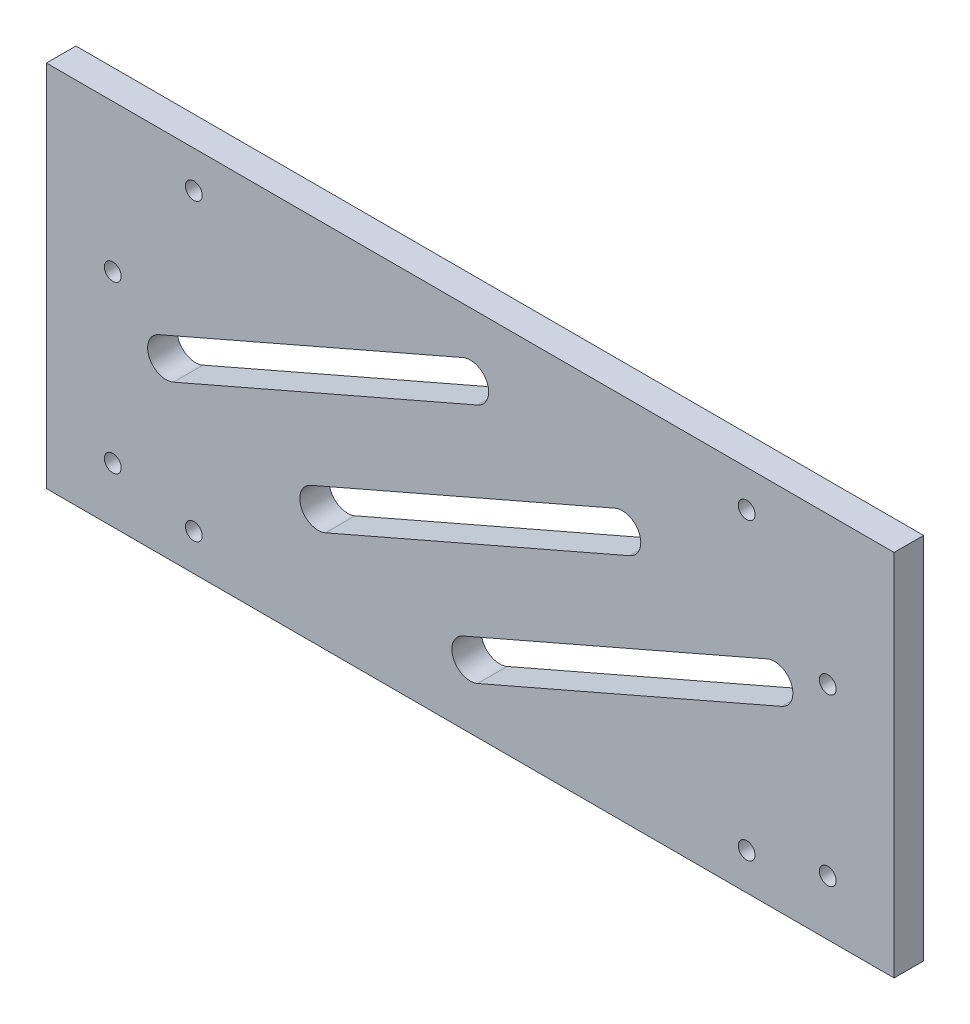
ISO-10303-21;
HEADER;
FILE_DESCRIPTION(('STEP AP214'),'2;1');
FILE_NAME('part.step','',(''),(''),'','','');
FILE_SCHEMA(('AUTOMOTIVE_DESIGN { 1 0 10303 214 1 1 1 1 }'));
ENDSEC;
DATA;
#1=APPLICATION_CONTEXT('core data for automotive mechanical design processes');
#2=APPLICATION_PROTOCOL_DEFINITION('international standard','automotive_design',2000,#1);
#3=PRODUCT_CONTEXT('',#1,'mechanical');
#4=PRODUCT('Part','Part','',(#3));
#5=PRODUCT_RELATED_PRODUCT_CATEGORY('part','',(#4));
#6=PRODUCT_DEFINITION_FORMATION('','',#4);
#7=PRODUCT_DEFINITION_CONTEXT('part definition',#1,'design');
#8=PRODUCT_DEFINITION('design','',#6,#7);
#9=PRODUCT_DEFINITION_SHAPE('','',#8);
#10=(LENGTH_UNIT() NAMED_UNIT(*) SI_UNIT(.MILLI.,.METRE.));
#11=(NAMED_UNIT(*) PLANE_ANGLE_UNIT() SI_UNIT($,.RADIAN.));
#12=(NAMED_UNIT(*) SI_UNIT($,.STERADIAN.) SOLID_ANGLE_UNIT());
#13=UNCERTAINTY_MEASURE_WITH_UNIT(LENGTH_MEASURE(1.E-05),#10,'distance_accuracy_value','');
#14=(GEOMETRIC_REPRESENTATION_CONTEXT(3) GLOBAL_UNCERTAINTY_ASSIGNED_CONTEXT((#13)) GLOBAL_UNIT_ASSIGNED_CONTEXT((#10,
#11,#12)) REPRESENTATION_CONTEXT('',''));
#15=CARTESIAN_POINT('',(0.,0.,0.));
#16=DIRECTION('',(0.,0.,1.));
#17=DIRECTION('',(1.,0.,0.));
#18=AXIS2_PLACEMENT_3D('',#15,#16,#17);
#19=CARTESIAN_POINT('',(0.,0.,8.));
#20=DIRECTION('',(0.,0.,1.));
#21=DIRECTION('',(1.,0.,0.));
#22=AXIS2_PLACEMENT_3D('',#19,#20,#21);
#23=PLANE('',#22);
#24=CARTESIAN_POINT('',(75.,40.,8.));
#25=DIRECTION('',(0.,0.,1.));
#26=DIRECTION('',(1.,0.,0.));
#27=AXIS2_PLACEMENT_3D('',#24,#25,#26);
#28=CIRCLE('',#27,2.28499999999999);
#29=CARTESIAN_POINT('',(77.285,40.,8.));
#30=VERTEX_POINT('',#29);
#31=EDGE_CURVE('E256',#30,#30,#28,.T.);
#32=ORIENTED_EDGE('',*,*,#31,.F.);
#33=EDGE_LOOP('',(#32));
#34=FACE_BOUND('',#33,.T.);
#35=CARTESIAN_POINT('',(97.,-35.,8.));
#36=DIRECTION('',(0.,0.,1.));
#37=DIRECTION('',(-1.,0.,0.));
#38=AXIS2_PLACEMENT_3D('',#35,#36,#37);
#39=CIRCLE('',#38,2.28499999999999);
#40=CARTESIAN_POINT('',(94.715,-35.,8.));
#41=VERTEX_POINT('',#40);
#42=EDGE_CURVE('E268',#41,#41,#39,.T.);
#43=ORIENTED_EDGE('',*,*,#42,.F.);
#44=EDGE_LOOP('',(#43));
#45=FACE_BOUND('',#44,.T.);
#46=CARTESIAN_POINT('',(-97.,9.99999999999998,8.));
#47=DIRECTION('',(0.,0.,1.));
#48=DIRECTION('',(1.,0.,0.));
#49=AXIS2_PLACEMENT_3D('',#46,#47,#48);
#50=CIRCLE('',#49,2.28499999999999);
#51=CARTESIAN_POINT('',(-94.715,9.99999999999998,8.));
#52=VERTEX_POINT('',#51);
#53=EDGE_CURVE('E280',#52,#52,#50,.T.);
#54=ORIENTED_EDGE('',*,*,#53,.F.);
#55=EDGE_LOOP('',(#54));
#56=FACE_BOUND('',#55,.T.);
#57=CARTESIAN_POINT('',(-97.,-35.,8.));
#58=DIRECTION('',(0.,0.,1.));
#59=DIRECTION('',(1.,0.,0.));
#60=AXIS2_PLACEMENT_3D('',#57,#58,#59);
#61=CIRCLE('',#60,2.28499999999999);
#62=CARTESIAN_POINT('',(-94.715,-35.,8.));
#63=VERTEX_POINT('',#62);
#64=EDGE_CURVE('E292',#63,#63,#61,.T.);
#65=ORIENTED_EDGE('',*,*,#64,.F.);
#66=EDGE_LOOP('',(#65));
#67=FACE_BOUND('',#66,.T.);
#68=DIRECTION('',(-1.,0.,0.));
#69=VECTOR('',#68,1.);
#70=CARTESIAN_POINT('',(115.,50.,8.));
#71=LINE('',#70,#69);
#72=CARTESIAN_POINT('',(115.,50.,8.));
#73=VERTEX_POINT('',#72);
#74=CARTESIAN_POINT('',(-115.,50.,8.));
#75=VERTEX_POINT('',#74);
#76=EDGE_CURVE('E298',#73,#75,#71,.T.);
#77=ORIENTED_EDGE('',*,*,#76,.T.);
#78=DIRECTION('',(0.,-1.,0.));
#79=VECTOR('',#78,1.);
#80=CARTESIAN_POINT('',(-115.,50.,8.));
#81=LINE('',#80,#79);
#82=CARTESIAN_POINT('',(-115.,-50.,8.));
#83=VERTEX_POINT('',#82);
#84=EDGE_CURVE('E301',#75,#83,#81,.T.);
#85=ORIENTED_EDGE('',*,*,#84,.T.);
#86=DIRECTION('',(1.,0.,0.));
#87=VECTOR('',#86,1.);
#88=CARTESIAN_POINT('',(-115.,-50.,8.));
#89=LINE('',#88,#87);
#90=CARTESIAN_POINT('',(115.,-50.,8.));
#91=VERTEX_POINT('',#90);
#92=EDGE_CURVE('E304',#83,#91,#89,.T.);
#93=ORIENTED_EDGE('',*,*,#92,.T.);
#94=DIRECTION('',(0.,1.,0.));
#95=VECTOR('',#94,1.);
#96=CARTESIAN_POINT('',(115.,-50.,8.));
#97=LINE('',#96,#95);
#98=EDGE_CURVE('E306',#91,#73,#97,.T.);
#99=ORIENTED_EDGE('',*,*,#98,.T.);
#100=EDGE_LOOP('',(#77,#85,#93,#99));
#101=FACE_BOUND('',#100,.T.);
#102=CARTESIAN_POINT('',(-75.,-40.,8.));
#103=DIRECTION('',(0.,0.,1.));
#104=DIRECTION('',(1.,0.,0.));
#105=AXIS2_PLACEMENT_3D('',#102,#103,#104);
#106=CIRCLE('',#105,2.28499999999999);
#107=CARTESIAN_POINT('',(-72.715,-40.,8.));
#108=VERTEX_POINT('',#107);
#109=EDGE_CURVE('E286',#108,#108,#106,.T.);
#110=ORIENTED_EDGE('',*,*,#109,.F.);
#111=EDGE_LOOP('',(#110));
#112=FACE_BOUND('',#111,.T.);
#113=CARTESIAN_POINT('',(75.,-40.,8.));
#114=DIRECTION('',(0.,0.,1.));
#115=DIRECTION('',(-1.,0.,0.));
#116=AXIS2_PLACEMENT_3D('',#113,#114,#115);
#117=CIRCLE('',#116,2.28499999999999);
#118=CARTESIAN_POINT('',(72.715,-40.,8.));
#119=VERTEX_POINT('',#118);
#120=EDGE_CURVE('E274',#119,#119,#117,.T.);
#121=ORIENTED_EDGE('',*,*,#120,.F.);
#122=EDGE_LOOP('',(#121));
#123=FACE_BOUND('',#122,.T.);
#124=CARTESIAN_POINT('',(97.,9.99999999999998,8.));
#125=DIRECTION('',(0.,0.,1.));
#126=DIRECTION('',(-1.,0.,0.));
#127=AXIS2_PLACEMENT_3D('',#124,#125,#126);
#128=CIRCLE('',#127,2.28499999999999);
#129=CARTESIAN_POINT('',(94.715,9.99999999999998,8.));
#130=VERTEX_POINT('',#129);
#131=EDGE_CURVE('E262',#130,#130,#128,.T.);
#132=ORIENTED_EDGE('',*,*,#131,.F.);
#133=EDGE_LOOP('',(#132));
#134=FACE_BOUND('',#133,.T.);
#135=CARTESIAN_POINT('',(-75.,40.,8.));
#136=DIRECTION('',(0.,0.,1.));
#137=DIRECTION('',(-1.,0.,0.));
#138=AXIS2_PLACEMENT_3D('',#135,#136,#137);
#139=CIRCLE('',#138,2.28499999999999);
#140=CARTESIAN_POINT('',(-77.285,40.,8.));
#141=VERTEX_POINT('',#140);
#142=EDGE_CURVE('E250',#141,#141,#139,.T.);
#143=ORIENTED_EDGE('',*,*,#142,.F.);
#144=EDGE_LOOP('',(#143));
#145=FACE_BOUND('',#144,.T.);
#146=DIRECTION('',(0.917070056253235,0.39872611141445,0.));
#147=VECTOR('',#146,1.);
#148=CARTESIAN_POINT('',(-80.5426745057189,-7.7578232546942,8.));
#149=LINE('',#148,#147);
#150=CARTESIAN_POINT('',(-80.5426745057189,-7.7578232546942,8.));
#151=VERTEX_POINT('',#150);
#152=CARTESIAN_POINT('',(1.99363055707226,28.1275267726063,8.));
#153=VERTEX_POINT('',#152);
#154=EDGE_CURVE('E221',#151,#153,#149,.T.);
#155=ORIENTED_EDGE('',*,*,#154,.F.);
#156=CARTESIAN_POINT('',(-82.5363050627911,-3.17247297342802,8.));
#157=DIRECTION('',(0.,0.,1.));
#158=DIRECTION('',(1.,0.,0.));
#159=AXIS2_PLACEMENT_3D('',#156,#157,#158);
#160=CIRCLE('',#159,5.00000000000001);
#161=CARTESIAN_POINT('',(-84.5299356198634,1.41287730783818,8.));
#162=VERTEX_POINT('',#161);
#163=EDGE_CURVE('E219',#162,#151,#160,.T.);
#164=ORIENTED_EDGE('',*,*,#163,.F.);
#165=DIRECTION('',(-0.917070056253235,-0.39872611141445,0.));
#166=VECTOR('',#165,1.);
#167=CARTESIAN_POINT('',(-84.5299356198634,1.41287730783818,8.));
#168=LINE('',#167,#166);
#169=CARTESIAN_POINT('',(-1.99363055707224,37.2982273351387,8.));
#170=VERTEX_POINT('',#169);
#171=EDGE_CURVE('E227',#170,#162,#168,.T.);
#172=ORIENTED_EDGE('',*,*,#171,.F.);
#173=CARTESIAN_POINT('',(0.,32.7128770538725,8.));
#174=DIRECTION('',(0.,0.,1.));
#175=DIRECTION('',(1.,0.,0.));
#176=AXIS2_PLACEMENT_3D('',#173,#174,#175);
#177=CIRCLE('',#176,5.);
#178=EDGE_CURVE('E224',#153,#170,#177,.T.);
#179=ORIENTED_EDGE('',*,*,#178,.F.);
#180=EDGE_LOOP('',(#155,#164,#172,#179));
#181=FACE_BOUND('',#180,.T.);
#182=DIRECTION('',(0.917070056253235,0.39872611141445,0.));
#183=VECTOR('',#182,1.);
#184=CARTESIAN_POINT('',(-39.2745219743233,-22.5280252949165,8.));
#185=LINE('',#184,#183);
#186=CARTESIAN_POINT('',(-39.2745219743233,-22.5280252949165,8.));
#187=VERTEX_POINT('',#186);
#188=CARTESIAN_POINT('',(43.2617830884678,13.3573247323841,8.));
#189=VERTEX_POINT('',#188);
#190=EDGE_CURVE('E190',#187,#189,#185,.T.);
#191=ORIENTED_EDGE('',*,*,#190,.F.);
#192=CARTESIAN_POINT('',(-41.2681525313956,-17.9426750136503,8.));
#193=DIRECTION('',(0.,0.,1.));
#194=DIRECTION('',(1.,0.,0.));
#195=AXIS2_PLACEMENT_3D('',#192,#193,#194);
#196=CIRCLE('',#195,5.00000000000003);
#197=CARTESIAN_POINT('',(-43.2617830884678,-13.357324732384,8.));
#198=VERTEX_POINT('',#197);
#199=EDGE_CURVE('E188',#198,#187,#196,.T.);
#200=ORIENTED_EDGE('',*,*,#199,.F.);
#201=DIRECTION('',(-0.917070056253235,-0.39872611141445,0.));
#202=VECTOR('',#201,1.);
#203=CARTESIAN_POINT('',(-43.2617830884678,-13.357324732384,8.));
#204=LINE('',#203,#202);
#205=CARTESIAN_POINT('',(39.2745219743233,22.5280252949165,8.));
#206=VERTEX_POINT('',#205);
#207=EDGE_CURVE('E196',#206,#198,#204,.T.);
#208=ORIENTED_EDGE('',*,*,#207,.F.);
#209=CARTESIAN_POINT('',(41.2681525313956,17.9426750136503,8.));
#210=DIRECTION('',(0.,0.,1.));
#211=DIRECTION('',(1.,0.,0.));
#212=AXIS2_PLACEMENT_3D('',#209,#210,#211);
#213=CIRCLE('',#212,5.00000000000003);
#214=EDGE_CURVE('E193',#189,#206,#213,.T.);
#215=ORIENTED_EDGE('',*,*,#214,.F.);
#216=EDGE_LOOP('',(#191,#200,#208,#215));
#217=FACE_BOUND('',#216,.T.);
#218=DIRECTION('',(0.917070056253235,0.39872611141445,0.));
#219=VECTOR('',#218,1.);
#220=CARTESIAN_POINT('',(1.99363055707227,-37.2982273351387,8.));
#221=LINE('',#220,#219);
#222=CARTESIAN_POINT('',(1.99363055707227,-37.2982273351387,8.));
#223=VERTEX_POINT('',#222);
#224=CARTESIAN_POINT('',(84.5299356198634,-1.41287730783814,8.));
#225=VERTEX_POINT('',#224);
#226=EDGE_CURVE('E160',#223,#225,#221,.T.);
#227=ORIENTED_EDGE('',*,*,#226,.F.);
#228=CARTESIAN_POINT('',(0.,-32.7128770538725,8.));
#229=DIRECTION('',(0.,0.,1.));
#230=DIRECTION('',(1.,0.,0.));
#231=AXIS2_PLACEMENT_3D('',#228,#229,#230);
#232=CIRCLE('',#231,5.00000000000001);
#233=CARTESIAN_POINT('',(-1.99363055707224,-28.1275267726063,8.));
#234=VERTEX_POINT('',#233);
#235=EDGE_CURVE('E152',#234,#223,#232,.T.);
#236=ORIENTED_EDGE('',*,*,#235,.F.);
#237=DIRECTION('',(-0.917070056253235,-0.39872611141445,0.));
#238=VECTOR('',#237,1.);
#239=CARTESIAN_POINT('',(-1.99363055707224,-28.1275267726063,8.));
#240=LINE('',#239,#238);
#241=CARTESIAN_POINT('',(80.5426745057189,7.75782325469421,8.));
#242=VERTEX_POINT('',#241);
#243=EDGE_CURVE('E174',#242,#234,#240,.T.);
#244=ORIENTED_EDGE('',*,*,#243,.F.);
#245=CARTESIAN_POINT('',(82.5363050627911,3.17247297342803,8.));
#246=DIRECTION('',(0.,0.,1.));
#247=DIRECTION('',(1.,0.,0.));
#248=AXIS2_PLACEMENT_3D('',#245,#246,#247);
#249=CIRCLE('',#248,5.00000000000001);
#250=EDGE_CURVE('E172',#225,#242,#249,.T.);
#251=ORIENTED_EDGE('',*,*,#250,.F.);
#252=EDGE_LOOP('',(#227,#236,#244,#251));
#253=FACE_BOUND('',#252,.T.);
#254=ADVANCED_FACE('F39',(#34,#45,#56,#67,#101,#112,#123,#134,#145,#181,#217,#253),#23,.T.);
#255=CARTESIAN_POINT('',(0.,0.,0.));
#256=DIRECTION('',(0.,0.,1.));
#257=DIRECTION('',(1.,0.,0.));
#258=AXIS2_PLACEMENT_3D('',#255,#256,#257);
#259=PLANE('',#258);
#260=CARTESIAN_POINT('',(-41.2681525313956,-17.9426750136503,0.));
#261=DIRECTION('',(0.,0.,1.));
#262=DIRECTION('',(1.,0.,0.));
#263=AXIS2_PLACEMENT_3D('',#260,#261,#262);
#264=CIRCLE('',#263,5.00000000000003);
#265=CARTESIAN_POINT('',(-43.2617830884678,-13.357324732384,0.));
#266=VERTEX_POINT('',#265);
#267=CARTESIAN_POINT('',(-39.2745219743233,-22.5280252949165,0.));
#268=VERTEX_POINT('',#267);
#269=EDGE_CURVE('E168',#266,#268,#264,.T.);
#270=ORIENTED_EDGE('',*,*,#269,.T.);
#271=DIRECTION('',(0.917070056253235,0.39872611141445,0.));
#272=VECTOR('',#271,1.);
#273=CARTESIAN_POINT('',(-39.2745219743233,-22.5280252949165,0.));
#274=LINE('',#273,#272);
#275=CARTESIAN_POINT('',(43.2617830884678,13.3573247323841,0.));
#276=VERTEX_POINT('',#275);
#277=EDGE_CURVE('E201',#268,#276,#274,.T.);
#278=ORIENTED_EDGE('',*,*,#277,.T.);
#279=CARTESIAN_POINT('',(41.2681525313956,17.9426750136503,0.));
#280=DIRECTION('',(0.,0.,1.));
#281=DIRECTION('',(1.,0.,0.));
#282=AXIS2_PLACEMENT_3D('',#279,#280,#281);
#283=CIRCLE('',#282,5.00000000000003);
#284=CARTESIAN_POINT('',(39.2745219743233,22.5280252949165,0.));
#285=VERTEX_POINT('',#284);
#286=EDGE_CURVE('E204',#276,#285,#283,.T.);
#287=ORIENTED_EDGE('',*,*,#286,.T.);
#288=DIRECTION('',(-0.917070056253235,-0.39872611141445,0.));
#289=VECTOR('',#288,1.);
#290=CARTESIAN_POINT('',(-43.2617830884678,-13.357324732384,0.));
#291=LINE('',#290,#289);
#292=EDGE_CURVE('E191',#285,#266,#291,.T.);
#293=ORIENTED_EDGE('',*,*,#292,.T.);
#294=EDGE_LOOP('',(#270,#278,#287,#293));
#295=FACE_BOUND('',#294,.T.);
#296=CARTESIAN_POINT('',(-75.,40.,0.));
#297=DIRECTION('',(0.,0.,1.));
#298=DIRECTION('',(-1.,0.,0.));
#299=AXIS2_PLACEMENT_3D('',#296,#297,#298);
#300=CIRCLE('',#299,2.28499999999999);
#301=CARTESIAN_POINT('',(-77.285,40.,0.));
#302=VERTEX_POINT('',#301);
#303=EDGE_CURVE('E249',#302,#302,#300,.T.);
#304=ORIENTED_EDGE('',*,*,#303,.T.);
#305=EDGE_LOOP('',(#304));
#306=FACE_BOUND('',#305,.T.);
#307=CARTESIAN_POINT('',(75.,40.,0.));
#308=DIRECTION('',(0.,0.,1.));
#309=DIRECTION('',(1.,0.,0.));
#310=AXIS2_PLACEMENT_3D('',#307,#308,#309);
#311=CIRCLE('',#310,2.28499999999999);
#312=CARTESIAN_POINT('',(77.285,40.,0.));
#313=VERTEX_POINT('',#312);
#314=EDGE_CURVE('E253',#313,#313,#311,.T.);
#315=ORIENTED_EDGE('',*,*,#314,.T.);
#316=EDGE_LOOP('',(#315));
#317=FACE_BOUND('',#316,.T.);
#318=CARTESIAN_POINT('',(97.,9.99999999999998,0.));
#319=DIRECTION('',(0.,0.,1.));
#320=DIRECTION('',(-1.,0.,0.));
#321=AXIS2_PLACEMENT_3D('',#318,#319,#320);
#322=CIRCLE('',#321,2.28499999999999);
#323=CARTESIAN_POINT('',(94.715,9.99999999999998,0.));
#324=VERTEX_POINT('',#323);
#325=EDGE_CURVE('E259',#324,#324,#322,.T.);
#326=ORIENTED_EDGE('',*,*,#325,.T.);
#327=EDGE_LOOP('',(#326));
#328=FACE_BOUND('',#327,.T.);
#329=CARTESIAN_POINT('',(97.,-35.,0.));
#330=DIRECTION('',(0.,0.,1.));
#331=DIRECTION('',(-1.,0.,0.));
#332=AXIS2_PLACEMENT_3D('',#329,#330,#331);
#333=CIRCLE('',#332,2.28499999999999);
#334=CARTESIAN_POINT('',(94.715,-35.,0.));
#335=VERTEX_POINT('',#334);
#336=EDGE_CURVE('E265',#335,#335,#333,.T.);
#337=ORIENTED_EDGE('',*,*,#336,.T.);
#338=EDGE_LOOP('',(#337));
#339=FACE_BOUND('',#338,.T.);
#340=CARTESIAN_POINT('',(75.,-40.,0.));
#341=DIRECTION('',(0.,0.,1.));
#342=DIRECTION('',(-1.,0.,0.));
#343=AXIS2_PLACEMENT_3D('',#340,#341,#342);
#344=CIRCLE('',#343,2.28499999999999);
#345=CARTESIAN_POINT('',(72.715,-40.,0.));
#346=VERTEX_POINT('',#345);
#347=EDGE_CURVE('E271',#346,#346,#344,.T.);
#348=ORIENTED_EDGE('',*,*,#347,.T.);
#349=EDGE_LOOP('',(#348));
#350=FACE_BOUND('',#349,.T.);
#351=CARTESIAN_POINT('',(-97.,9.99999999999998,0.));
#352=DIRECTION('',(0.,0.,1.));
#353=DIRECTION('',(1.,0.,0.));
#354=AXIS2_PLACEMENT_3D('',#351,#352,#353);
#355=CIRCLE('',#354,2.28499999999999);
#356=CARTESIAN_POINT('',(-94.715,9.99999999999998,0.));
#357=VERTEX_POINT('',#356);
#358=EDGE_CURVE('E277',#357,#357,#355,.T.);
#359=ORIENTED_EDGE('',*,*,#358,.T.);
#360=EDGE_LOOP('',(#359));
#361=FACE_BOUND('',#360,.T.);
#362=CARTESIAN_POINT('',(-75.,-40.,0.));
#363=DIRECTION('',(0.,0.,1.));
#364=DIRECTION('',(1.,0.,0.));
#365=AXIS2_PLACEMENT_3D('',#362,#363,#364);
#366=CIRCLE('',#365,2.28499999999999);
#367=CARTESIAN_POINT('',(-72.715,-40.,0.));
#368=VERTEX_POINT('',#367);
#369=EDGE_CURVE('E283',#368,#368,#366,.T.);
#370=ORIENTED_EDGE('',*,*,#369,.T.);
#371=EDGE_LOOP('',(#370));
#372=FACE_BOUND('',#371,.T.);
#373=CARTESIAN_POINT('',(-97.,-35.,0.));
#374=DIRECTION('',(0.,0.,1.));
#375=DIRECTION('',(1.,0.,0.));
#376=AXIS2_PLACEMENT_3D('',#373,#374,#375);
#377=CIRCLE('',#376,2.28499999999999);
#378=CARTESIAN_POINT('',(-94.715,-35.,0.));
#379=VERTEX_POINT('',#378);
#380=EDGE_CURVE('E289',#379,#379,#377,.T.);
#381=ORIENTED_EDGE('',*,*,#380,.T.);
#382=EDGE_LOOP('',(#381));
#383=FACE_BOUND('',#382,.T.);
#384=DIRECTION('',(-1.,0.,0.));
#385=VECTOR('',#384,1.);
#386=CARTESIAN_POINT('',(115.,50.,0.));
#387=LINE('',#386,#385);
#388=CARTESIAN_POINT('',(115.,50.,0.));
#389=VERTEX_POINT('',#388);
#390=CARTESIAN_POINT('',(-115.,50.,0.));
#391=VERTEX_POINT('',#390);
#392=EDGE_CURVE('E295',#389,#391,#387,.T.);
#393=ORIENTED_EDGE('',*,*,#392,.F.);
#394=DIRECTION('',(0.,1.,0.));
#395=VECTOR('',#394,1.);
#396=CARTESIAN_POINT('',(115.,-50.,0.));
#397=LINE('',#396,#395);
#398=CARTESIAN_POINT('',(115.,-50.,0.));
#399=VERTEX_POINT('',#398);
#400=EDGE_CURVE('E302',#399,#389,#397,.T.);
#401=ORIENTED_EDGE('',*,*,#400,.F.);
#402=DIRECTION('',(1.,0.,0.));
#403=VECTOR('',#402,1.);
#404=CARTESIAN_POINT('',(-115.,-50.,0.));
#405=LINE('',#404,#403);
#406=CARTESIAN_POINT('',(-115.,-50.,0.));
#407=VERTEX_POINT('',#406);
#408=EDGE_CURVE('E313',#407,#399,#405,.T.);
#409=ORIENTED_EDGE('',*,*,#408,.F.);
#410=DIRECTION('',(0.,-1.,0.));
#411=VECTOR('',#410,1.);
#412=CARTESIAN_POINT('',(-115.,50.,0.));
#413=LINE('',#412,#411);
#414=EDGE_CURVE('E311',#391,#407,#413,.T.);
#415=ORIENTED_EDGE('',*,*,#414,.F.);
#416=EDGE_LOOP('',(#393,#401,#409,#415));
#417=FACE_BOUND('',#416,.T.);
#418=CARTESIAN_POINT('',(-82.5363050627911,-3.17247297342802,0.));
#419=DIRECTION('',(0.,0.,1.));
#420=DIRECTION('',(1.,0.,0.));
#421=AXIS2_PLACEMENT_3D('',#418,#419,#420);
#422=CIRCLE('',#421,5.00000000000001);
#423=CARTESIAN_POINT('',(-84.5299356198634,1.41287730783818,0.));
#424=VERTEX_POINT('',#423);
#425=CARTESIAN_POINT('',(-80.5426745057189,-7.7578232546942,0.));
#426=VERTEX_POINT('',#425);
#427=EDGE_CURVE('E218',#424,#426,#422,.T.);
#428=ORIENTED_EDGE('',*,*,#427,.T.);
#429=DIRECTION('',(0.917070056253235,0.39872611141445,0.));
#430=VECTOR('',#429,1.);
#431=CARTESIAN_POINT('',(-80.5426745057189,-7.7578232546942,0.));
#432=LINE('',#431,#430);
#433=CARTESIAN_POINT('',(1.99363055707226,28.1275267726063,0.));
#434=VERTEX_POINT('',#433);
#435=EDGE_CURVE('E232',#426,#434,#432,.T.);
#436=ORIENTED_EDGE('',*,*,#435,.T.);
#437=CARTESIAN_POINT('',(0.,32.7128770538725,0.));
#438=DIRECTION('',(0.,0.,1.));
#439=DIRECTION('',(1.,0.,0.));
#440=AXIS2_PLACEMENT_3D('',#437,#438,#439);
#441=CIRCLE('',#440,5.);
#442=CARTESIAN_POINT('',(-1.99363055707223,37.2982273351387,0.));
#443=VERTEX_POINT('',#442);
#444=EDGE_CURVE('E235',#434,#443,#441,.T.);
#445=ORIENTED_EDGE('',*,*,#444,.T.);
#446=DIRECTION('',(-0.917070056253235,-0.39872611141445,0.));
#447=VECTOR('',#446,1.);
#448=CARTESIAN_POINT('',(-84.5299356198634,1.41287730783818,0.));
#449=LINE('',#448,#447);
#450=EDGE_CURVE('E222',#443,#424,#449,.T.);
#451=ORIENTED_EDGE('',*,*,#450,.T.);
#452=EDGE_LOOP('',(#428,#436,#445,#451));
#453=FACE_BOUND('',#452,.T.);
#454=CARTESIAN_POINT('',(0.,-32.7128770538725,0.));
#455=DIRECTION('',(0.,0.,1.));
#456=DIRECTION('',(1.,0.,0.));
#457=AXIS2_PLACEMENT_3D('',#454,#455,#456);
#458=CIRCLE('',#457,5.00000000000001);
#459=CARTESIAN_POINT('',(-1.99363055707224,-28.1275267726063,0.));
#460=VERTEX_POINT('',#459);
#461=CARTESIAN_POINT('',(1.99363055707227,-37.2982273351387,0.));
#462=VERTEX_POINT('',#461);
#463=EDGE_CURVE('E62',#460,#462,#458,.T.);
#464=ORIENTED_EDGE('',*,*,#463,.T.);
#465=DIRECTION('',(0.917070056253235,0.39872611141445,0.));
#466=VECTOR('',#465,1.);
#467=CARTESIAN_POINT('',(1.99363055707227,-37.2982273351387,0.));
#468=LINE('',#467,#466);
#469=CARTESIAN_POINT('',(84.5299356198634,-1.41287730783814,0.));
#470=VERTEX_POINT('',#469);
#471=EDGE_CURVE('E167',#462,#470,#468,.T.);
#472=ORIENTED_EDGE('',*,*,#471,.T.);
#473=CARTESIAN_POINT('',(82.5363050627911,3.17247297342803,0.));
#474=DIRECTION('',(0.,0.,1.));
#475=DIRECTION('',(1.,0.,0.));
#476=AXIS2_PLACEMENT_3D('',#473,#474,#475);
#477=CIRCLE('',#476,5.00000000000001);
#478=CARTESIAN_POINT('',(80.5426745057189,7.7578232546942,0.));
#479=VERTEX_POINT('',#478);
#480=EDGE_CURVE('E180',#470,#479,#477,.T.);
#481=ORIENTED_EDGE('',*,*,#480,.T.);
#482=DIRECTION('',(-0.917070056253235,-0.39872611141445,0.));
#483=VECTOR('',#482,1.);
#484=CARTESIAN_POINT('',(-1.99363055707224,-28.1275267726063,0.));
#485=LINE('',#484,#483);
#486=EDGE_CURVE('E161',#479,#460,#485,.T.);
#487=ORIENTED_EDGE('',*,*,#486,.T.);
#488=EDGE_LOOP('',(#464,#472,#481,#487));
#489=FACE_BOUND('',#488,.T.);
#490=ADVANCED_FACE('F331',(#295,#306,#317,#328,#339,#350,#361,#372,#383,#417,#453,#489),#259,.F.);
#491=CARTESIAN_POINT('',(115.,50.,8.));
#492=DIRECTION('',(0.,-1.,0.));
#493=DIRECTION('',(0.,0.,-1.));
#494=AXIS2_PLACEMENT_3D('',#491,#492,#493);
#495=PLANE('',#494);
#496=ORIENTED_EDGE('',*,*,#392,.T.);
#497=DIRECTION('',(0.,0.,-1.));
#498=VECTOR('',#497,1.);
#499=CARTESIAN_POINT('',(-115.,50.,8.));
#500=LINE('',#499,#498);
#501=EDGE_CURVE('E11',#75,#391,#500,.T.);
#502=ORIENTED_EDGE('',*,*,#501,.F.);
#503=ORIENTED_EDGE('',*,*,#76,.F.);
#504=DIRECTION('',(0.,0.,-1.));
#505=VECTOR('',#504,1.);
#506=CARTESIAN_POINT('',(115.,50.,8.));
#507=LINE('',#506,#505);
#508=EDGE_CURVE('E308',#73,#389,#507,.T.);
#509=ORIENTED_EDGE('',*,*,#508,.T.);
#510=EDGE_LOOP('',(#496,#502,#503,#509));
#511=FACE_BOUND('',#510,.T.);
#512=ADVANCED_FACE('F41',(#511),#495,.F.);
#513=CARTESIAN_POINT('',(-115.,50.,8.));
#514=DIRECTION('',(1.,0.,0.));
#515=DIRECTION('',(0.,0.,-1.));
#516=AXIS2_PLACEMENT_3D('',#513,#514,#515);
#517=PLANE('',#516);
#518=ORIENTED_EDGE('',*,*,#414,.T.);
#519=DIRECTION('',(0.,0.,-1.));
#520=VECTOR('',#519,1.);
#521=CARTESIAN_POINT('',(-115.,-50.,8.));
#522=LINE('',#521,#520);
#523=EDGE_CURVE('E47',#83,#407,#522,.T.);
#524=ORIENTED_EDGE('',*,*,#523,.F.);
#525=ORIENTED_EDGE('',*,*,#84,.F.);
#526=ORIENTED_EDGE('',*,*,#501,.T.);
#527=EDGE_LOOP('',(#518,#524,#525,#526));
#528=FACE_BOUND('',#527,.T.);
#529=ADVANCED_FACE('F342',(#528),#517,.F.);
#530=CARTESIAN_POINT('',(-115.,-50.,8.));
#531=DIRECTION('',(0.,1.,0.));
#532=DIRECTION('',(-1.,0.,0.));
#533=AXIS2_PLACEMENT_3D('',#530,#531,#532);
#534=PLANE('',#533);
#535=ORIENTED_EDGE('',*,*,#408,.T.);
#536=DIRECTION('',(0.,0.,-1.));
#537=VECTOR('',#536,1.);
#538=CARTESIAN_POINT('',(115.,-50.,8.));
#539=LINE('',#538,#537);
#540=EDGE_CURVE('E318',#91,#399,#539,.T.);
#541=ORIENTED_EDGE('',*,*,#540,.F.);
#542=ORIENTED_EDGE('',*,*,#92,.F.);
#543=ORIENTED_EDGE('',*,*,#523,.T.);
#544=EDGE_LOOP('',(#535,#541,#542,#543));
#545=FACE_BOUND('',#544,.T.);
#546=ADVANCED_FACE('F325',(#545),#534,.F.);
#547=CARTESIAN_POINT('',(115.,-50.,8.));
#548=DIRECTION('',(-1.,0.,0.));
#549=DIRECTION('',(0.,0.,1.));
#550=AXIS2_PLACEMENT_3D('',#547,#548,#549);
#551=PLANE('',#550);
#552=ORIENTED_EDGE('',*,*,#400,.T.);
#553=ORIENTED_EDGE('',*,*,#508,.F.);
#554=ORIENTED_EDGE('',*,*,#98,.F.);
#555=ORIENTED_EDGE('',*,*,#540,.T.);
#556=EDGE_LOOP('',(#552,#553,#554,#555));
#557=FACE_BOUND('',#556,.T.);
#558=ADVANCED_FACE('F335',(#557),#551,.F.);
#559=CARTESIAN_POINT('',(-97.,-35.,8.));
#560=DIRECTION('',(0.,0.,-1.));
#561=DIRECTION('',(-1.,0.,0.));
#562=AXIS2_PLACEMENT_3D('',#559,#560,#561);
#563=CYLINDRICAL_SURFACE('',#562,2.28499999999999);
#564=ORIENTED_EDGE('',*,*,#64,.T.);
#565=EDGE_LOOP('',(#564));
#566=FACE_BOUND('',#565,.T.);
#567=ORIENTED_EDGE('',*,*,#380,.F.);
#568=EDGE_LOOP('',(#567));
#569=FACE_BOUND('',#568,.T.);
#570=ADVANCED_FACE('F360',(#566,#569),#563,.F.);
#571=CARTESIAN_POINT('',(-75.,-40.,8.));
#572=DIRECTION('',(0.,0.,-1.));
#573=DIRECTION('',(-1.,0.,0.));
#574=AXIS2_PLACEMENT_3D('',#571,#572,#573);
#575=CYLINDRICAL_SURFACE('',#574,2.28499999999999);
#576=ORIENTED_EDGE('',*,*,#109,.T.);
#577=EDGE_LOOP('',(#576));
#578=FACE_BOUND('',#577,.T.);
#579=ORIENTED_EDGE('',*,*,#369,.F.);
#580=EDGE_LOOP('',(#579));
#581=FACE_BOUND('',#580,.T.);
#582=ADVANCED_FACE('F367',(#578,#581),#575,.F.);
#583=CARTESIAN_POINT('',(-97.,9.99999999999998,8.));
#584=DIRECTION('',(0.,0.,-1.));
#585=DIRECTION('',(-1.,0.,0.));
#586=AXIS2_PLACEMENT_3D('',#583,#584,#585);
#587=CYLINDRICAL_SURFACE('',#586,2.28499999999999);
#588=ORIENTED_EDGE('',*,*,#53,.T.);
#589=EDGE_LOOP('',(#588));
#590=FACE_BOUND('',#589,.T.);
#591=ORIENTED_EDGE('',*,*,#358,.F.);
#592=EDGE_LOOP('',(#591));
#593=FACE_BOUND('',#592,.T.);
#594=ADVANCED_FACE('F372',(#590,#593),#587,.F.);
#595=CARTESIAN_POINT('',(75.,-40.,8.));
#596=DIRECTION('',(0.,0.,-1.));
#597=DIRECTION('',(-1.,0.,0.));
#598=AXIS2_PLACEMENT_3D('',#595,#596,#597);
#599=CYLINDRICAL_SURFACE('',#598,2.28499999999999);
#600=ORIENTED_EDGE('',*,*,#120,.T.);
#601=EDGE_LOOP('',(#600));
#602=FACE_BOUND('',#601,.T.);
#603=ORIENTED_EDGE('',*,*,#347,.F.);
#604=EDGE_LOOP('',(#603));
#605=FACE_BOUND('',#604,.T.);
#606=ADVANCED_FACE('F382',(#602,#605),#599,.F.);
#607=CARTESIAN_POINT('',(97.,-35.,8.));
#608=DIRECTION('',(0.,0.,-1.));
#609=DIRECTION('',(-1.,0.,0.));
#610=AXIS2_PLACEMENT_3D('',#607,#608,#609);
#611=CYLINDRICAL_SURFACE('',#610,2.28499999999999);
#612=ORIENTED_EDGE('',*,*,#42,.T.);
#613=EDGE_LOOP('',(#612));
#614=FACE_BOUND('',#613,.T.);
#615=ORIENTED_EDGE('',*,*,#336,.F.);
#616=EDGE_LOOP('',(#615));
#617=FACE_BOUND('',#616,.T.);
#618=ADVANCED_FACE('F389',(#614,#617),#611,.F.);
#619=CARTESIAN_POINT('',(97.,9.99999999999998,8.));
#620=DIRECTION('',(0.,0.,-1.));
#621=DIRECTION('',(-1.,0.,0.));
#622=AXIS2_PLACEMENT_3D('',#619,#620,#621);
#623=CYLINDRICAL_SURFACE('',#622,2.28499999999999);
#624=ORIENTED_EDGE('',*,*,#131,.T.);
#625=EDGE_LOOP('',(#624));
#626=FACE_BOUND('',#625,.T.);
#627=ORIENTED_EDGE('',*,*,#325,.F.);
#628=EDGE_LOOP('',(#627));
#629=FACE_BOUND('',#628,.T.);
#630=ADVANCED_FACE('F393',(#626,#629),#623,.F.);
#631=CARTESIAN_POINT('',(75.,40.,8.));
#632=DIRECTION('',(0.,0.,-1.));
#633=DIRECTION('',(-1.,0.,0.));
#634=AXIS2_PLACEMENT_3D('',#631,#632,#633);
#635=CYLINDRICAL_SURFACE('',#634,2.28499999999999);
#636=ORIENTED_EDGE('',*,*,#31,.T.);
#637=EDGE_LOOP('',(#636));
#638=FACE_BOUND('',#637,.T.);
#639=ORIENTED_EDGE('',*,*,#314,.F.);
#640=EDGE_LOOP('',(#639));
#641=FACE_BOUND('',#640,.T.);
#642=ADVANCED_FACE('F397',(#638,#641),#635,.F.);
#643=CARTESIAN_POINT('',(-75.,40.,8.));
#644=DIRECTION('',(0.,0.,-1.));
#645=DIRECTION('',(-1.,0.,0.));
#646=AXIS2_PLACEMENT_3D('',#643,#644,#645);
#647=CYLINDRICAL_SURFACE('',#646,2.28499999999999);
#648=ORIENTED_EDGE('',*,*,#142,.T.);
#649=EDGE_LOOP('',(#648));
#650=FACE_BOUND('',#649,.T.);
#651=ORIENTED_EDGE('',*,*,#303,.F.);
#652=EDGE_LOOP('',(#651));
#653=FACE_BOUND('',#652,.T.);
#654=ADVANCED_FACE('F401',(#650,#653),#647,.F.);
#655=CARTESIAN_POINT('',(-82.5363050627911,-3.17247297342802,8.));
#656=DIRECTION('',(0.,0.,-1.));
#657=DIRECTION('',(-1.,0.,0.));
#658=AXIS2_PLACEMENT_3D('',#655,#656,#657);
#659=CYLINDRICAL_SURFACE('',#658,5.00000000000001);
#660=ORIENTED_EDGE('',*,*,#427,.F.);
#661=DIRECTION('',(0.,0.,-1.));
#662=VECTOR('',#661,1.);
#663=CARTESIAN_POINT('',(-84.5299356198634,1.41287730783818,8.));
#664=LINE('',#663,#662);
#665=EDGE_CURVE('E229',#162,#424,#664,.T.);
#666=ORIENTED_EDGE('',*,*,#665,.F.);
#667=ORIENTED_EDGE('',*,*,#163,.T.);
#668=DIRECTION('',(0.,0.,-1.));
#669=VECTOR('',#668,1.);
#670=CARTESIAN_POINT('',(-80.5426745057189,-7.7578232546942,8.));
#671=LINE('',#670,#669);
#672=EDGE_CURVE('E246',#151,#426,#671,.T.);
#673=ORIENTED_EDGE('',*,*,#672,.T.);
#674=EDGE_LOOP('',(#660,#666,#667,#673));
#675=FACE_BOUND('',#674,.T.);
#676=ADVANCED_FACE('F405',(#675),#659,.F.);
#677=CARTESIAN_POINT('',(-80.5426745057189,-7.7578232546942,8.));
#678=DIRECTION('',(-0.39872611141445,0.917070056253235,0.));
#679=DIRECTION('',(-0.917070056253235,-0.39872611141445,0.));
#680=AXIS2_PLACEMENT_3D('',#677,#678,#679);
#681=PLANE('',#680);
#682=ORIENTED_EDGE('',*,*,#435,.F.);
#683=ORIENTED_EDGE('',*,*,#672,.F.);
#684=ORIENTED_EDGE('',*,*,#154,.T.);
#685=DIRECTION('',(0.,0.,-1.));
#686=VECTOR('',#685,1.);
#687=CARTESIAN_POINT('',(1.99363055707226,28.1275267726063,8.));
#688=LINE('',#687,#686);
#689=EDGE_CURVE('E244',#153,#434,#688,.T.);
#690=ORIENTED_EDGE('',*,*,#689,.T.);
#691=EDGE_LOOP('',(#682,#683,#684,#690));
#692=FACE_BOUND('',#691,.T.);
#693=ADVANCED_FACE('F409',(#692),#681,.T.);
#694=CARTESIAN_POINT('',(0.,32.7128770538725,8.));
#695=DIRECTION('',(0.,0.,-1.));
#696=DIRECTION('',(-1.,0.,0.));
#697=AXIS2_PLACEMENT_3D('',#694,#695,#696);
#698=CYLINDRICAL_SURFACE('',#697,5.);
#699=ORIENTED_EDGE('',*,*,#444,.F.);
#700=ORIENTED_EDGE('',*,*,#689,.F.);
#701=ORIENTED_EDGE('',*,*,#178,.T.);
#702=DIRECTION('',(0.,0.,-1.));
#703=VECTOR('',#702,1.);
#704=CARTESIAN_POINT('',(-1.99363055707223,37.2982273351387,8.));
#705=LINE('',#704,#703);
#706=EDGE_CURVE('E242',#170,#443,#705,.T.);
#707=ORIENTED_EDGE('',*,*,#706,.T.);
#708=EDGE_LOOP('',(#699,#700,#701,#707));
#709=FACE_BOUND('',#708,.T.);
#710=ADVANCED_FACE('F413',(#709),#698,.F.);
#711=CARTESIAN_POINT('',(-84.5299356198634,1.41287730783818,8.));
#712=DIRECTION('',(0.39872611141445,-0.917070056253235,0.));
#713=DIRECTION('',(0.917070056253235,0.39872611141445,0.));
#714=AXIS2_PLACEMENT_3D('',#711,#712,#713);
#715=PLANE('',#714);
#716=ORIENTED_EDGE('',*,*,#450,.F.);
#717=ORIENTED_EDGE('',*,*,#706,.F.);
#718=ORIENTED_EDGE('',*,*,#171,.T.);
#719=ORIENTED_EDGE('',*,*,#665,.T.);
#720=EDGE_LOOP('',(#716,#717,#718,#719));
#721=FACE_BOUND('',#720,.T.);
#722=ADVANCED_FACE('F417',(#721),#715,.T.);
#723=CARTESIAN_POINT('',(-41.2681525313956,-17.9426750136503,8.));
#724=DIRECTION('',(0.,0.,-1.));
#725=DIRECTION('',(-1.,0.,0.));
#726=AXIS2_PLACEMENT_3D('',#723,#724,#725);
#727=CYLINDRICAL_SURFACE('',#726,5.00000000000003);
#728=ORIENTED_EDGE('',*,*,#269,.F.);
#729=DIRECTION('',(0.,0.,-1.));
#730=VECTOR('',#729,1.);
#731=CARTESIAN_POINT('',(-43.2617830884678,-13.357324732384,8.));
#732=LINE('',#731,#730);
#733=EDGE_CURVE('E198',#198,#266,#732,.T.);
#734=ORIENTED_EDGE('',*,*,#733,.F.);
#735=ORIENTED_EDGE('',*,*,#199,.T.);
#736=DIRECTION('',(0.,0.,-1.));
#737=VECTOR('',#736,1.);
#738=CARTESIAN_POINT('',(-39.2745219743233,-22.5280252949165,8.));
#739=LINE('',#738,#737);
#740=EDGE_CURVE('E215',#187,#268,#739,.T.);
#741=ORIENTED_EDGE('',*,*,#740,.T.);
#742=EDGE_LOOP('',(#728,#734,#735,#741));
#743=FACE_BOUND('',#742,.T.);
#744=ADVANCED_FACE('F421',(#743),#727,.F.);
#745=CARTESIAN_POINT('',(-39.2745219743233,-22.5280252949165,8.));
#746=DIRECTION('',(-0.39872611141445,0.917070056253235,0.));
#747=DIRECTION('',(-0.917070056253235,-0.39872611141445,0.));
#748=AXIS2_PLACEMENT_3D('',#745,#746,#747);
#749=PLANE('',#748);
#750=ORIENTED_EDGE('',*,*,#277,.F.);
#751=ORIENTED_EDGE('',*,*,#740,.F.);
#752=ORIENTED_EDGE('',*,*,#190,.T.);
#753=DIRECTION('',(0.,0.,-1.));
#754=VECTOR('',#753,1.);
#755=CARTESIAN_POINT('',(43.2617830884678,13.3573247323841,8.));
#756=LINE('',#755,#754);
#757=EDGE_CURVE('E213',#189,#276,#756,.T.);
#758=ORIENTED_EDGE('',*,*,#757,.T.);
#759=EDGE_LOOP('',(#750,#751,#752,#758));
#760=FACE_BOUND('',#759,.T.);
#761=ADVANCED_FACE('F425',(#760),#749,.T.);
#762=CARTESIAN_POINT('',(41.2681525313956,17.9426750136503,8.));
#763=DIRECTION('',(0.,0.,-1.));
#764=DIRECTION('',(-1.,0.,0.));
#765=AXIS2_PLACEMENT_3D('',#762,#763,#764);
#766=CYLINDRICAL_SURFACE('',#765,5.00000000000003);
#767=ORIENTED_EDGE('',*,*,#286,.F.);
#768=ORIENTED_EDGE('',*,*,#757,.F.);
#769=ORIENTED_EDGE('',*,*,#214,.T.);
#770=DIRECTION('',(0.,0.,-1.));
#771=VECTOR('',#770,1.);
#772=CARTESIAN_POINT('',(39.2745219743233,22.5280252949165,8.));
#773=LINE('',#772,#771);
#774=EDGE_CURVE('E211',#206,#285,#773,.T.);
#775=ORIENTED_EDGE('',*,*,#774,.T.);
#776=EDGE_LOOP('',(#767,#768,#769,#775));
#777=FACE_BOUND('',#776,.T.);
#778=ADVANCED_FACE('F429',(#777),#766,.F.);
#779=CARTESIAN_POINT('',(-43.2617830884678,-13.357324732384,8.));
#780=DIRECTION('',(0.39872611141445,-0.917070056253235,0.));
#781=DIRECTION('',(0.917070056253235,0.39872611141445,0.));
#782=AXIS2_PLACEMENT_3D('',#779,#780,#781);
#783=PLANE('',#782);
#784=ORIENTED_EDGE('',*,*,#292,.F.);
#785=ORIENTED_EDGE('',*,*,#774,.F.);
#786=ORIENTED_EDGE('',*,*,#207,.T.);
#787=ORIENTED_EDGE('',*,*,#733,.T.);
#788=EDGE_LOOP('',(#784,#785,#786,#787));
#789=FACE_BOUND('',#788,.T.);
#790=ADVANCED_FACE('F433',(#789),#783,.T.);
#791=CARTESIAN_POINT('',(0.,-32.7128770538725,8.));
#792=DIRECTION('',(0.,0.,-1.));
#793=DIRECTION('',(-1.,0.,0.));
#794=AXIS2_PLACEMENT_3D('',#791,#792,#793);
#795=CYLINDRICAL_SURFACE('',#794,5.00000000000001);
#796=ORIENTED_EDGE('',*,*,#463,.F.);
#797=DIRECTION('',(0.,0.,-1.));
#798=VECTOR('',#797,1.);
#799=CARTESIAN_POINT('',(-1.99363055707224,-28.1275267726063,8.));
#800=LINE('',#799,#798);
#801=EDGE_CURVE('E156',#234,#460,#800,.T.);
#802=ORIENTED_EDGE('',*,*,#801,.F.);
#803=ORIENTED_EDGE('',*,*,#235,.T.);
#804=DIRECTION('',(0.,0.,-1.));
#805=VECTOR('',#804,1.);
#806=CARTESIAN_POINT('',(1.99363055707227,-37.2982273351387,8.));
#807=LINE('',#806,#805);
#808=EDGE_CURVE('E155',#223,#462,#807,.T.);
#809=ORIENTED_EDGE('',*,*,#808,.T.);
#810=EDGE_LOOP('',(#796,#802,#803,#809));
#811=FACE_BOUND('',#810,.T.);
#812=ADVANCED_FACE('F154',(#811),#795,.F.);
#813=CARTESIAN_POINT('',(1.99363055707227,-37.2982273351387,8.));
#814=DIRECTION('',(-0.39872611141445,0.917070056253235,0.));
#815=DIRECTION('',(-0.917070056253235,-0.39872611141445,0.));
#816=AXIS2_PLACEMENT_3D('',#813,#814,#815);
#817=PLANE('',#816);
#818=ORIENTED_EDGE('',*,*,#471,.F.);
#819=ORIENTED_EDGE('',*,*,#808,.F.);
#820=ORIENTED_EDGE('',*,*,#226,.T.);
#821=DIRECTION('',(0.,0.,-1.));
#822=VECTOR('',#821,1.);
#823=CARTESIAN_POINT('',(84.5299356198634,-1.41287730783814,8.));
#824=LINE('',#823,#822);
#825=EDGE_CURVE('E169',#225,#470,#824,.T.);
#826=ORIENTED_EDGE('',*,*,#825,.T.);
#827=EDGE_LOOP('',(#818,#819,#820,#826));
#828=FACE_BOUND('',#827,.T.);
#829=ADVANCED_FACE('F164',(#828),#817,.T.);
#830=CARTESIAN_POINT('',(82.5363050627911,3.17247297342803,8.));
#831=DIRECTION('',(0.,0.,-1.));
#832=DIRECTION('',(-1.,0.,0.));
#833=AXIS2_PLACEMENT_3D('',#830,#831,#832);
#834=CYLINDRICAL_SURFACE('',#833,5.00000000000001);
#835=ORIENTED_EDGE('',*,*,#480,.F.);
#836=ORIENTED_EDGE('',*,*,#825,.F.);
#837=ORIENTED_EDGE('',*,*,#250,.T.);
#838=DIRECTION('',(0.,0.,-1.));
#839=VECTOR('',#838,1.);
#840=CARTESIAN_POINT('',(80.5426745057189,7.7578232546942,8.));
#841=LINE('',#840,#839);
#842=EDGE_CURVE('E54',#242,#479,#841,.T.);
#843=ORIENTED_EDGE('',*,*,#842,.T.);
#844=EDGE_LOOP('',(#835,#836,#837,#843));
#845=FACE_BOUND('',#844,.T.);
#846=ADVANCED_FACE('F442',(#845),#834,.F.);
#847=CARTESIAN_POINT('',(-1.99363055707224,-28.1275267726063,8.));
#848=DIRECTION('',(0.39872611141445,-0.917070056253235,0.));
#849=DIRECTION('',(0.917070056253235,0.39872611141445,0.));
#850=AXIS2_PLACEMENT_3D('',#847,#848,#849);
#851=PLANE('',#850);
#852=ORIENTED_EDGE('',*,*,#486,.F.);
#853=ORIENTED_EDGE('',*,*,#842,.F.);
#854=ORIENTED_EDGE('',*,*,#243,.T.);
#855=ORIENTED_EDGE('',*,*,#801,.T.);
#856=EDGE_LOOP('',(#852,#853,#854,#855));
#857=FACE_BOUND('',#856,.T.);
#858=ADVANCED_FACE('F445',(#857),#851,.T.);
#859=CLOSED_SHELL('',(#254,#490,#512,#529,#546,#558,#570,#582,#594,#606,#618,#630,#642,#654,
#676,#693,#710,#722,#744,#761,#778,#790,#812,#829,#846,#858));
#860=MANIFOLD_SOLID_BREP('B2',#859);
#861=ADVANCED_BREP_SHAPE_REPRESENTATION('',(#18,#860),#14);
#862=SHAPE_DEFINITION_REPRESENTATION(#9,#861);
ENDSEC;
END-ISO-10303-21;
